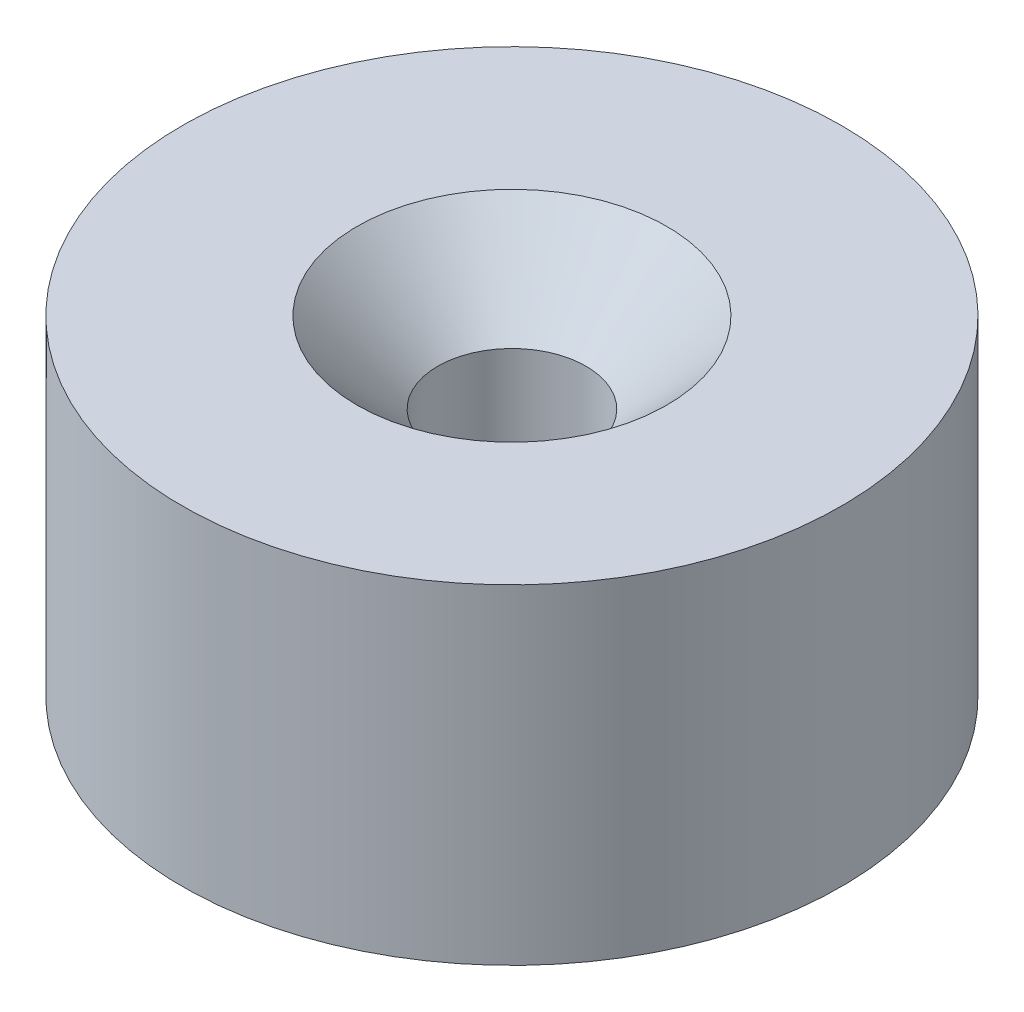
ISO-10303-21;
HEADER;
FILE_DESCRIPTION(('STEP AP214'),'2;1');
FILE_NAME('part.step','',(''),(''),'','','');
FILE_SCHEMA(('AUTOMOTIVE_DESIGN { 1 0 10303 214 1 1 1 1 }'));
ENDSEC;
DATA;
#1=APPLICATION_CONTEXT('core data for automotive mechanical design processes');
#2=APPLICATION_PROTOCOL_DEFINITION('international standard','automotive_design',2000,#1);
#3=PRODUCT_CONTEXT('',#1,'mechanical');
#4=PRODUCT('Part','Part','',(#3));
#5=PRODUCT_RELATED_PRODUCT_CATEGORY('part','',(#4));
#6=PRODUCT_DEFINITION_FORMATION('','',#4);
#7=PRODUCT_DEFINITION_CONTEXT('part definition',#1,'design');
#8=PRODUCT_DEFINITION('design','',#6,#7);
#9=PRODUCT_DEFINITION_SHAPE('','',#8);
#10=(LENGTH_UNIT() NAMED_UNIT(*) SI_UNIT(.MILLI.,.METRE.));
#11=(NAMED_UNIT(*) PLANE_ANGLE_UNIT() SI_UNIT($,.RADIAN.));
#12=(NAMED_UNIT(*) SI_UNIT($,.STERADIAN.) SOLID_ANGLE_UNIT());
#13=UNCERTAINTY_MEASURE_WITH_UNIT(LENGTH_MEASURE(1.E-05),#10,'distance_accuracy_value','');
#14=(GEOMETRIC_REPRESENTATION_CONTEXT(3) GLOBAL_UNCERTAINTY_ASSIGNED_CONTEXT((#13)) GLOBAL_UNIT_ASSIGNED_CONTEXT((#10,
#11,#12)) REPRESENTATION_CONTEXT('',''));
#15=CARTESIAN_POINT('',(0.,0.,0.));
#16=DIRECTION('',(0.,0.,1.));
#17=DIRECTION('',(1.,0.,0.));
#18=AXIS2_PLACEMENT_3D('',#15,#16,#17);
#19=CARTESIAN_POINT('',(0.,0.,-3.));
#20=DIRECTION('',(0.,-1.,0.));
#21=DIRECTION('',(0.,0.,-1.));
#22=AXIS2_PLACEMENT_3D('',#19,#20,#21);
#23=PLANE('',#22);
#24=CARTESIAN_POINT('',(0.,0.,0.));
#25=DIRECTION('',(0.,1.,0.));
#26=DIRECTION('',(0.,0.,1.));
#27=AXIS2_PLACEMENT_3D('',#24,#25,#26);
#28=CIRCLE('',#27,2.25);
#29=CARTESIAN_POINT('',(0.,0.,2.25));
#30=VERTEX_POINT('',#29);
#31=EDGE_CURVE('E49',#30,#30,#28,.T.);
#32=ORIENTED_EDGE('',*,*,#31,.T.);
#33=EDGE_LOOP('',(#32));
#34=FACE_BOUND('',#33,.T.);
#35=CARTESIAN_POINT('',(0.,0.,0.));
#36=DIRECTION('',(0.,-1.,0.));
#37=DIRECTION('',(0.,0.,-1.));
#38=AXIS2_PLACEMENT_3D('',#35,#36,#37);
#39=CIRCLE('',#38,3.);
#40=CARTESIAN_POINT('',(0.,0.,-3.));
#41=VERTEX_POINT('',#40);
#42=EDGE_CURVE('E44',#41,#41,#39,.T.);
#43=ORIENTED_EDGE('',*,*,#42,.T.);
#44=EDGE_LOOP('',(#43));
#45=FACE_BOUND('',#44,.T.);
#46=ADVANCED_FACE('F30',(#34,#45),#23,.T.);
#47=CARTESIAN_POINT('',(0.,14.5,0.));
#48=DIRECTION('',(0.,1.,0.));
#49=DIRECTION('',(0.,0.,1.));
#50=AXIS2_PLACEMENT_3D('',#47,#48,#49);
#51=PLANE('',#50);
#52=CARTESIAN_POINT('',(0.,14.5,0.));
#53=DIRECTION('',(0.,1.,0.));
#54=DIRECTION('',(0.,0.,1.));
#55=AXIS2_PLACEMENT_3D('',#52,#53,#54);
#56=CIRCLE('',#55,4.7);
#57=CARTESIAN_POINT('',(0.,14.5,4.7));
#58=VERTEX_POINT('',#57);
#59=EDGE_CURVE('E55',#58,#58,#56,.T.);
#60=ORIENTED_EDGE('',*,*,#59,.F.);
#61=EDGE_LOOP('',(#60));
#62=FACE_BOUND('',#61,.T.);
#63=CARTESIAN_POINT('',(0.,14.5,0.));
#64=DIRECTION('',(0.,-1.,0.));
#65=DIRECTION('',(0.,0.,-1.));
#66=AXIS2_PLACEMENT_3D('',#63,#64,#65);
#67=CIRCLE('',#66,10.);
#68=CARTESIAN_POINT('',(0.,14.5,-10.));
#69=VERTEX_POINT('',#68);
#70=EDGE_CURVE('E10',#69,#69,#67,.T.);
#71=ORIENTED_EDGE('',*,*,#70,.F.);
#72=EDGE_LOOP('',(#71));
#73=FACE_BOUND('',#72,.T.);
#74=ADVANCED_FACE('F61',(#62,#73),#51,.T.);
#75=CARTESIAN_POINT('',(0.,0.,0.));
#76=DIRECTION('',(0.,-1.,0.));
#77=DIRECTION('',(0.,0.,-1.));
#78=AXIS2_PLACEMENT_3D('',#75,#76,#77);
#79=CYLINDRICAL_SURFACE('',#78,10.);
#80=ORIENTED_EDGE('',*,*,#70,.T.);
#81=EDGE_LOOP('',(#80));
#82=FACE_BOUND('',#81,.T.);
#83=CARTESIAN_POINT('',(0.,4.5,0.));
#84=DIRECTION('',(0.,-1.,0.));
#85=DIRECTION('',(0.,0.,-1.));
#86=AXIS2_PLACEMENT_3D('',#83,#84,#85);
#87=CIRCLE('',#86,10.);
#88=CARTESIAN_POINT('',(0.,4.5,-10.));
#89=VERTEX_POINT('',#88);
#90=EDGE_CURVE('E36',#89,#89,#87,.T.);
#91=ORIENTED_EDGE('',*,*,#90,.F.);
#92=EDGE_LOOP('',(#91));
#93=FACE_BOUND('',#92,.T.);
#94=ADVANCED_FACE('F64',(#82,#93),#79,.T.);
#95=CARTESIAN_POINT('',(0.,4.5,-10.));
#96=DIRECTION('',(0.,-1.,0.));
#97=DIRECTION('',(0.,0.,-1.));
#98=AXIS2_PLACEMENT_3D('',#95,#96,#97);
#99=PLANE('',#98);
#100=ORIENTED_EDGE('',*,*,#90,.T.);
#101=EDGE_LOOP('',(#100));
#102=FACE_BOUND('',#101,.T.);
#103=CARTESIAN_POINT('',(0.,4.5,0.));
#104=DIRECTION('',(0.,-1.,0.));
#105=DIRECTION('',(0.,0.,-1.));
#106=AXIS2_PLACEMENT_3D('',#103,#104,#105);
#107=CIRCLE('',#106,3.);
#108=CARTESIAN_POINT('',(0.,4.5,-3.));
#109=VERTEX_POINT('',#108);
#110=EDGE_CURVE('E40',#109,#109,#107,.T.);
#111=ORIENTED_EDGE('',*,*,#110,.F.);
#112=EDGE_LOOP('',(#111));
#113=FACE_BOUND('',#112,.T.);
#114=ADVANCED_FACE('F69',(#102,#113),#99,.T.);
#115=CARTESIAN_POINT('',(0.,0.,0.));
#116=DIRECTION('',(0.,-1.,0.));
#117=DIRECTION('',(0.,0.,-1.));
#118=AXIS2_PLACEMENT_3D('',#115,#116,#117);
#119=CYLINDRICAL_SURFACE('',#118,3.);
#120=ORIENTED_EDGE('',*,*,#110,.T.);
#121=EDGE_LOOP('',(#120));
#122=FACE_BOUND('',#121,.T.);
#123=ORIENTED_EDGE('',*,*,#42,.F.);
#124=EDGE_LOOP('',(#123));
#125=FACE_BOUND('',#124,.T.);
#126=ADVANCED_FACE('F75',(#122,#125),#119,.T.);
#127=CARTESIAN_POINT('',(0.,14.5,0.));
#128=DIRECTION('',(0.,1.,0.));
#129=DIRECTION('',(0.,0.,1.));
#130=AXIS2_PLACEMENT_3D('',#127,#128,#129);
#131=CYLINDRICAL_SURFACE('',#130,2.25);
#132=ORIENTED_EDGE('',*,*,#31,.F.);
#133=EDGE_LOOP('',(#132));
#134=FACE_BOUND('',#133,.T.);
#135=CARTESIAN_POINT('',(0.,12.05,0.));
#136=DIRECTION('',(0.,1.,0.));
#137=DIRECTION('',(0.,0.,1.));
#138=AXIS2_PLACEMENT_3D('',#135,#136,#137);
#139=CIRCLE('',#138,2.25);
#140=CARTESIAN_POINT('',(0.,12.05,2.25));
#141=VERTEX_POINT('',#140);
#142=EDGE_CURVE('E52',#141,#141,#139,.T.);
#143=ORIENTED_EDGE('',*,*,#142,.T.);
#144=EDGE_LOOP('',(#143));
#145=FACE_BOUND('',#144,.T.);
#146=ADVANCED_FACE('F78',(#134,#145),#131,.F.);
#147=CARTESIAN_POINT('',(0.,14.5,0.));
#148=DIRECTION('',(0.,1.,0.));
#149=DIRECTION('',(0.,0.,1.));
#150=AXIS2_PLACEMENT_3D('',#147,#148,#149);
#151=CONICAL_SURFACE('',#150,4.7,0.785398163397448);
#152=ORIENTED_EDGE('',*,*,#142,.F.);
#153=EDGE_LOOP('',(#152));
#154=FACE_BOUND('',#153,.T.);
#155=ORIENTED_EDGE('',*,*,#59,.T.);
#156=EDGE_LOOP('',(#155));
#157=FACE_BOUND('',#156,.T.);
#158=ADVANCED_FACE('F59',(#154,#157),#151,.F.);
#159=CLOSED_SHELL('',(#46,#74,#94,#114,#126,#146,#158));
#160=MANIFOLD_SOLID_BREP('B2',#159);
#161=ADVANCED_BREP_SHAPE_REPRESENTATION('',(#18,#160),#14);
#162=SHAPE_DEFINITION_REPRESENTATION(#9,#161);
ENDSEC;
END-ISO-10303-21;
